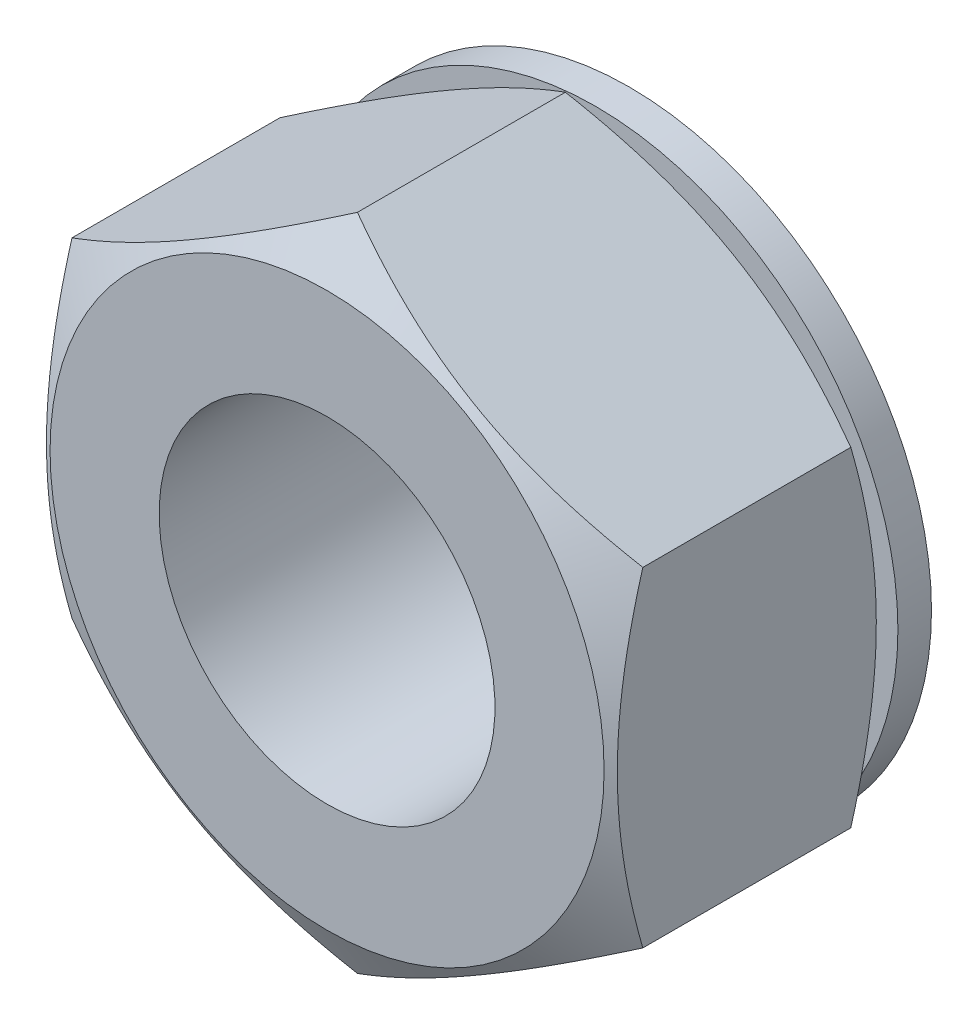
ISO-10303-21;
HEADER;
FILE_DESCRIPTION(('STEP AP214'),'2;1');
FILE_NAME('part.step','',(''),(''),'','','');
FILE_SCHEMA(('AUTOMOTIVE_DESIGN { 1 0 10303 214 1 1 1 1 }'));
ENDSEC;
DATA;
#1=APPLICATION_CONTEXT('core data for automotive mechanical design processes');
#2=APPLICATION_PROTOCOL_DEFINITION('international standard','automotive_design',2000,#1);
#3=PRODUCT_CONTEXT('',#1,'mechanical');
#4=PRODUCT('Part','Part','',(#3));
#5=PRODUCT_RELATED_PRODUCT_CATEGORY('part','',(#4));
#6=PRODUCT_DEFINITION_FORMATION('','',#4);
#7=PRODUCT_DEFINITION_CONTEXT('part definition',#1,'design');
#8=PRODUCT_DEFINITION('design','',#6,#7);
#9=PRODUCT_DEFINITION_SHAPE('','',#8);
#10=(LENGTH_UNIT() NAMED_UNIT(*) SI_UNIT(.MILLI.,.METRE.));
#11=(NAMED_UNIT(*) PLANE_ANGLE_UNIT() SI_UNIT($,.RADIAN.));
#12=(NAMED_UNIT(*) SI_UNIT($,.STERADIAN.) SOLID_ANGLE_UNIT());
#13=UNCERTAINTY_MEASURE_WITH_UNIT(LENGTH_MEASURE(1.E-05),#10,'distance_accuracy_value','');
#14=(GEOMETRIC_REPRESENTATION_CONTEXT(3) GLOBAL_UNCERTAINTY_ASSIGNED_CONTEXT((#13)) GLOBAL_UNIT_ASSIGNED_CONTEXT((#10,
#11,#12)) REPRESENTATION_CONTEXT('',''));
#15=CARTESIAN_POINT('',(0.,0.,0.));
#16=DIRECTION('',(0.,0.,1.));
#17=DIRECTION('',(1.,0.,0.));
#18=AXIS2_PLACEMENT_3D('',#15,#16,#17);
#19=CARTESIAN_POINT('',(8.5,-4.90747728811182,1.));
#20=DIRECTION('',(1.,0.,0.));
#21=DIRECTION('',(0.,0.,-1.));
#22=AXIS2_PLACEMENT_3D('',#19,#20,#21);
#23=PLANE('',#22);
#24=DIRECTION('',(0.,0.,1.));
#25=VECTOR('',#24,1.);
#26=CARTESIAN_POINT('',(8.5,-4.90747728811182,1.));
#27=LINE('',#26,#25);
#28=CARTESIAN_POINT('',(8.5,-4.90747728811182,1.90352694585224));
#29=VERTEX_POINT('',#28);
#30=CARTESIAN_POINT('',(8.5,-4.90747728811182,8.09647305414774));
#31=VERTEX_POINT('',#30);
#32=EDGE_CURVE('E23',#29,#31,#27,.T.);
#33=ORIENTED_EDGE('',*,*,#32,.F.);
#34=CARTESIAN_POINT('',(8.5,-13.0915549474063,5.24868234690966));
#35=CARTESIAN_POINT('',(8.5,-12.7210522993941,5.06932129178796));
#36=CARTESIAN_POINT('',(8.5,-12.3496893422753,4.8917064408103));
#37=CARTESIAN_POINT('',(8.5,-11.6047849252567,4.54095312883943));
#38=CARTESIAN_POINT('',(8.5,-11.2312431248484,4.36781539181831));
#39=CARTESIAN_POINT('',(8.5,-10.4795547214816,4.02610976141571));
#40=CARTESIAN_POINT('',(8.5,-10.1013940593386,3.85757268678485));
#41=CARTESIAN_POINT('',(8.5,-9.34203313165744,3.52751781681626));
#42=CARTESIAN_POINT('',(8.5,-8.9608330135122,3.36599968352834));
#43=CARTESIAN_POINT('',(8.5,-8.18283943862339,3.0469393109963));
#44=CARTESIAN_POINT('',(8.5,-7.78593021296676,2.88967777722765));
#45=CARTESIAN_POINT('',(8.5,-6.98743583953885,2.58727756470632));
#46=CARTESIAN_POINT('',(8.5,-6.58585016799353,2.44214025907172));
#47=CARTESIAN_POINT('',(8.5,-5.77814054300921,2.16786564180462));
#48=CARTESIAN_POINT('',(8.5,-5.37202798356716,2.03869514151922));
#49=CARTESIAN_POINT('',(8.5,-4.55399343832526,1.80055665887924));
#50=CARTESIAN_POINT('',(8.5,-4.14207335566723,1.69158221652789));
#51=CARTESIAN_POINT('',(8.5,-3.31438796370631,1.49970658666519));
#52=CARTESIAN_POINT('',(8.5,-2.89865550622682,1.41666755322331));
#53=CARTESIAN_POINT('',(8.5,-2.27134456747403,1.31520073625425));
#54=CARTESIAN_POINT('',(8.5,-2.06160610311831,1.2852256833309));
#55=CARTESIAN_POINT('',(8.5,-1.64111774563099,1.23356271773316));
#56=CARTESIAN_POINT('',(8.5,-1.43036795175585,1.21187400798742));
#57=CARTESIAN_POINT('',(8.5,-1.01085234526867,1.17748318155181));
#58=CARTESIAN_POINT('',(8.5,-0.802095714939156,1.16466947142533));
#59=CARTESIAN_POINT('',(8.5,-0.384227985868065,1.14787493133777));
#60=CARTESIAN_POINT('',(8.5,-0.17511689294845,1.14389395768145));
#61=CARTESIAN_POINT('',(8.5,0.243087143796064,1.14485962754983));
#62=CARTESIAN_POINT('',(8.5,0.45218008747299,1.14980633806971));
#63=CARTESIAN_POINT('',(8.5,0.869974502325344,1.1685082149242));
#64=CARTESIAN_POINT('',(8.5,1.07867595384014,1.18226381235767));
#65=CARTESIAN_POINT('',(8.5,1.5830262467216,1.22586154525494));
#66=CARTESIAN_POINT('',(8.5,1.87830686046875,1.26003717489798));
#67=CARTESIAN_POINT('',(8.5,2.46661820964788,1.34413868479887));
#68=CARTESIAN_POINT('',(8.5,2.75964862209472,1.39406678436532));
#69=CARTESIAN_POINT('',(8.5,3.34320037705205,1.50789692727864));
#70=CARTESIAN_POINT('',(8.5,3.63371951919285,1.57181014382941));
#71=CARTESIAN_POINT('',(8.5,4.21181524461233,1.7116655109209));
#72=CARTESIAN_POINT('',(8.5,4.49939187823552,1.78760745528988));
#73=CARTESIAN_POINT('',(8.5,5.07786906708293,1.95145666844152));
#74=CARTESIAN_POINT('',(8.5,5.36870556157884,2.0395885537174));
#75=CARTESIAN_POINT('',(8.5,5.94751266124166,2.22476097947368));
#76=CARTESIAN_POINT('',(8.5,6.23548324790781,2.3218015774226));
#77=CARTESIAN_POINT('',(8.5,6.80870426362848,2.52326797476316));
#78=CARTESIAN_POINT('',(8.5,7.09395560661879,2.62769118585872));
#79=CARTESIAN_POINT('',(8.5,7.66210792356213,2.84271370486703));
#80=CARTESIAN_POINT('',(8.5,7.94500892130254,2.9533129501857));
#81=CARTESIAN_POINT('',(8.5,8.59684880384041,3.2150416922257));
#82=CARTESIAN_POINT('',(8.5,8.9650387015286,3.36803342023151));
#83=CARTESIAN_POINT('',(8.5,9.69841979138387,3.68106229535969));
#84=CARTESIAN_POINT('',(8.5,10.0636108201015,3.84109982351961));
#85=CARTESIAN_POINT('',(8.5,10.7915324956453,4.16685178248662));
#86=CARTESIAN_POINT('',(8.5,11.1542626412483,4.33256733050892));
#87=CARTESIAN_POINT('',(8.5,11.8775879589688,4.66856623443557));
#88=CARTESIAN_POINT('',(8.5,12.2381831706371,4.83884950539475));
#89=CARTESIAN_POINT('',(8.5,12.9579418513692,5.18332507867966));
#90=CARTESIAN_POINT('',(8.5,13.317103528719,5.35752111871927));
#91=CARTESIAN_POINT('',(8.5,14.0339093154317,5.70901080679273));
#92=CARTESIAN_POINT('',(8.5,14.3915534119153,5.88630448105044));
#93=CARTESIAN_POINT('',(8.5,15.4624766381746,6.42198820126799));
#94=CARTESIAN_POINT('',(8.5,16.1738327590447,6.78422245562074));
#95=CARTESIAN_POINT('',(8.5,17.5359107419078,7.4866390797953));
#96=CARTESIAN_POINT('',(8.5,18.1869224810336,7.82626177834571));
#97=CARTESIAN_POINT('',(8.5,19.486513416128,8.51017567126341));
#98=CARTESIAN_POINT('',(8.5,20.1350925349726,8.85446701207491));
#99=CARTESIAN_POINT('',(8.5,21.4288467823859,9.54582326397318));
#100=CARTESIAN_POINT('',(8.5,22.0740263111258,9.89287995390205));
#101=CARTESIAN_POINT('',(8.5,23.3628204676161,10.5898096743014));
#102=CARTESIAN_POINT('',(8.5,24.0064351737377,10.9396825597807));
#103=CARTESIAN_POINT('',(8.5,24.6494692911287,11.2906121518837));
#104=B_SPLINE_CURVE_WITH_KNOTS('',3,(#34,#35,#36,#37,#38,#39,#40,#41,#42,#43,#44,#45,#46,#47,
#48,#49,#50,#51,#52,#53,#54,#55,#56,#57,#58,#59,#60,#61,#62,#63,#64,#65,#66,#67,#68,#69,#70,#71,
#72,#73,#74,#75,#76,#77,#78,#79,#80,#81,#82,#83,#84,#85,#86,#87,#88,#89,#90,#91,#92,#93,#94,#95,
#96,#97,#98,#99,#100,#101,#102,#103),.UNSPECIFIED.,.F.,.F.,(4,2,2,2,2,2,2,2,2,2,2,2,2,2,2,2,2,2,
2,2,2,2,2,2,2,2,2,2,2,2,2,2,2,2,4),(0.,1.23491770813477,2.47003387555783,3.71202833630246,
4.9539629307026,6.2345954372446,7.51537278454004,8.79344146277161,10.0711006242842,
11.3418487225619,11.9773195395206,12.6127292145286,13.2399967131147,13.867254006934,
14.4945160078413,15.121808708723,16.0130688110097,16.904454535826,17.7965550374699,
18.6886402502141,19.6001588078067,20.5116832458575,21.4228896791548,22.3340868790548,
23.5301212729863,24.7262204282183,25.9225562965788,27.1188699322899,28.3163795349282,
29.5138992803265,31.9086521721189,34.1114570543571,36.3143311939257,38.5121282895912,
40.7098129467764),.UNSPECIFIED.);
#105=CARTESIAN_POINT('',(8.5,4.90747728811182,1.90352694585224));
#106=VERTEX_POINT('',#105);
#107=EDGE_CURVE('E70',#29,#106,#104,.T.);
#108=ORIENTED_EDGE('',*,*,#107,.T.);
#109=DIRECTION('',(0.,0.,1.));
#110=VECTOR('',#109,1.);
#111=CARTESIAN_POINT('',(8.5,4.90747728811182,1.));
#112=LINE('',#111,#110);
#113=CARTESIAN_POINT('',(8.5,4.90747728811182,8.09647305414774));
#114=VERTEX_POINT('',#113);
#115=EDGE_CURVE('E38',#106,#114,#112,.T.);
#116=ORIENTED_EDGE('',*,*,#115,.T.);
#117=CARTESIAN_POINT('',(8.5,-13.217348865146,4.69031746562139));
#118=CARTESIAN_POINT('',(8.5,-12.8458016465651,4.8706926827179));
#119=CARTESIAN_POINT('',(8.5,-12.4734053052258,5.04934857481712));
#120=CARTESIAN_POINT('',(8.5,-11.7264629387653,5.40225544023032));
#121=CARTESIAN_POINT('',(8.5,-11.3519165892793,5.57650572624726));
#122=CARTESIAN_POINT('',(8.5,-10.598309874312,5.92050421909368));
#123=CARTESIAN_POINT('',(8.5,-10.2192360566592,6.09022305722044));
#124=CARTESIAN_POINT('',(8.5,-9.45808580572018,6.42276232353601));
#125=CARTESIAN_POINT('',(8.5,-9.07600951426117,6.58558307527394));
#126=CARTESIAN_POINT('',(8.5,-8.29577621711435,6.90765368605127));
#127=CARTESIAN_POINT('',(8.5,-7.89749985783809,7.06661599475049));
#128=CARTESIAN_POINT('',(8.5,-7.09630157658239,7.37259500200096));
#129=CARTESIAN_POINT('',(8.5,-6.69337914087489,7.51961036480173));
#130=CARTESIAN_POINT('',(8.5,-5.88298561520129,7.79786146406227));
#131=CARTESIAN_POINT('',(8.5,-5.47552550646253,7.92912884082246));
#132=CARTESIAN_POINT('',(8.5,-4.65477495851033,8.17169674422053));
#133=CARTESIAN_POINT('',(8.5,-4.24148638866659,8.28300352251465));
#134=CARTESIAN_POINT('',(8.5,-3.4110781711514,8.47973040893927));
#135=CARTESIAN_POINT('',(8.5,-2.99399303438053,8.56529227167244));
#136=CARTESIAN_POINT('',(8.5,-2.36453907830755,8.67064057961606));
#137=CARTESIAN_POINT('',(8.5,-2.15406819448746,8.70192568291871));
#138=CARTESIAN_POINT('',(8.5,-1.7320683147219,8.75621826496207));
#139=CARTESIAN_POINT('',(8.5,-1.52053942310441,8.77922654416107));
#140=CARTESIAN_POINT('',(8.5,-1.09948590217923,8.81621665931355));
#141=CARTESIAN_POINT('',(8.5,-0.889971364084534,8.83031290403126));
#142=CARTESIAN_POINT('',(8.5,-0.47053384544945,8.84963093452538));
#143=CARTESIAN_POINT('',(8.5,-0.26061087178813,8.85485286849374));
#144=CARTESIAN_POINT('',(8.5,0.159267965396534,8.85629759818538));
#145=CARTESIAN_POINT('',(8.5,0.369223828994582,8.8525203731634));
#146=CARTESIAN_POINT('',(8.5,0.788788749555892,8.83605958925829));
#147=CARTESIAN_POINT('',(8.5,0.998397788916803,8.82337559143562));
#148=CARTESIAN_POINT('',(8.5,1.50108256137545,8.78254579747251));
#149=CARTESIAN_POINT('',(8.5,1.793827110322,8.75023345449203));
#150=CARTESIAN_POINT('',(8.5,2.37715285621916,8.66999047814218));
#151=CARTESIAN_POINT('',(8.5,2.66773375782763,8.62205775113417));
#152=CARTESIAN_POINT('',(8.5,3.53589346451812,8.45736980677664));
#153=CARTESIAN_POINT('',(8.5,4.10956801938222,8.31975438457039));
#154=CARTESIAN_POINT('',(8.5,4.96741250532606,8.08098980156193));
#155=CARTESIAN_POINT('',(8.5,5.25602859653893,7.99489512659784));
#156=CARTESIAN_POINT('',(8.5,5.83045786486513,7.81373122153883));
#157=CARTESIAN_POINT('',(8.5,6.11627102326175,7.71866193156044));
#158=CARTESIAN_POINT('',(8.5,6.68518369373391,7.52107686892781));
#159=CARTESIAN_POINT('',(8.5,6.96828405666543,7.41856352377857));
#160=CARTESIAN_POINT('',(8.5,7.53213698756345,7.20729976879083));
#161=CARTESIAN_POINT('',(8.5,7.81288958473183,7.09854943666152));
#162=CARTESIAN_POINT('',(8.5,8.48212780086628,6.83212781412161));
#163=CARTESIAN_POINT('',(8.5,8.86963833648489,6.67201149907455));
#164=CARTESIAN_POINT('',(8.5,9.64130597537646,6.34386869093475));
#165=CARTESIAN_POINT('',(8.5,10.0254628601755,6.17584168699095));
#166=CARTESIAN_POINT('',(8.5,10.7910586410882,5.83348393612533));
#167=CARTESIAN_POINT('',(8.5,11.172496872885,5.65915170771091));
#168=CARTESIAN_POINT('',(8.5,11.9330253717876,5.30547364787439));
#169=CARTESIAN_POINT('',(8.5,12.3121156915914,5.12612792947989));
#170=CARTESIAN_POINT('',(8.5,13.0687747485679,4.76316764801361));
#171=CARTESIAN_POINT('',(8.5,13.4463412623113,4.57954845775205));
#172=CARTESIAN_POINT('',(8.5,14.1998317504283,4.2089715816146));
#173=CARTESIAN_POINT('',(8.5,14.5757557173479,4.0220138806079));
#174=CARTESIAN_POINT('',(8.5,15.7013597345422,3.45708243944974));
#175=CARTESIAN_POINT('',(8.5,16.448977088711,3.07499947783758));
#176=CARTESIAN_POINT('',(8.5,17.8763952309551,2.3362001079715));
#177=CARTESIAN_POINT('',(8.5,18.5565227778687,1.98011216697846));
#178=CARTESIAN_POINT('',(8.5,19.9142584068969,1.26310730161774));
#179=CARTESIAN_POINT('',(8.5,20.5918663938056,0.902190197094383));
#180=CARTESIAN_POINT('',(8.5,21.9433746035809,0.17762302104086));
#181=CARTESIAN_POINT('',(8.5,22.6172798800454,-0.186017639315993));
#182=CARTESIAN_POINT('',(8.5,23.963483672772,-0.91617087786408));
#183=CARTESIAN_POINT('',(8.5,24.6357822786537,-1.28268329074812));
#184=CARTESIAN_POINT('',(8.5,25.3074917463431,-1.65026503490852));
#185=B_SPLINE_CURVE_WITH_KNOTS('',3,(#117,#118,#119,#120,#121,#122,#123,#124,#125,#126,#127,
#128,#129,#130,#131,#132,#133,#134,#135,#136,#137,#138,#139,#140,#141,#142,#143,#144,#145,#146,
#147,#148,#149,#150,#151,#152,#153,#154,#155,#156,#157,#158,#159,#160,#161,#162,#163,#164,#165,
#166,#167,#168,#169,#170,#171,#172,#173,#174,#175,#176,#177,#178,#179,#180,#181,#182,#183,#184),
.UNSPECIFIED.,.F.,.F.,(4,2,2,2,2,2,2,2,2,2,2,2,2,2,2,2,2,2,2,2,2,2,2,2,2,2,2,2,2,2,2,2,2,4),(0.,
1.23906418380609,2.47832048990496,3.7242641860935,4.97014937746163,6.25648329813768,
7.54296084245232,8.82680874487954,10.1102538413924,11.3864970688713,12.0247099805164,
12.6628611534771,13.2926441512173,13.9224166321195,14.5521905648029,15.1819955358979,
16.0650645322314,16.9482519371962,18.7155902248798,19.6190649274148,20.5225456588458,
21.4257330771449,22.3289092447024,23.5866510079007,24.8444741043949,26.1025946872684,
27.3606869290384,28.6202113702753,29.8797415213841,32.3984513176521,34.7015479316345,
37.0047307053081,39.3019924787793,41.599122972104),.UNSPECIFIED.);
#186=EDGE_CURVE('E90',#31,#114,#185,.T.);
#187=ORIENTED_EDGE('',*,*,#186,.F.);
#188=EDGE_LOOP('',(#33,#108,#116,#187));
#189=FACE_BOUND('',#188,.T.);
#190=ADVANCED_FACE('F14',(#189),#23,.T.);
#191=CARTESIAN_POINT('',(8.5,-4.90747728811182,1.));
#192=DIRECTION('',(-0.5,0.866025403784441,0.));
#193=DIRECTION('',(0.866025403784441,0.5,0.));
#194=AXIS2_PLACEMENT_3D('',#191,#192,#193);
#195=PLANE('',#194);
#196=CARTESIAN_POINT('',(8.5002,-4.90736181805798,1.90359361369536));
#197=CARTESIAN_POINT('',(8.31336077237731,-5.01523349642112,1.84132370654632));
#198=CARTESIAN_POINT('',(8.1258249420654,-5.1235073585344,1.78187986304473));
#199=CARTESIAN_POINT('',(7.74923024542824,-5.34093440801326,1.66942267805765));
#200=CARTESIAN_POINT('',(7.56017075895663,-5.45008795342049,1.61641211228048));
#201=CARTESIAN_POINT('',(6.9899652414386,-5.77929626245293,1.46807095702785));
#202=CARTESIAN_POINT('',(6.60656835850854,-6.00065055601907,1.38369649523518));
#203=CARTESIAN_POINT('',(6.03282233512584,-6.33190297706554,1.28475758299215));
#204=CARTESIAN_POINT('',(5.84418723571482,-6.44081150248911,1.2565727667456));
#205=CARTESIAN_POINT('',(5.46606397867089,-6.65912106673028,1.2093116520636));
#206=CARTESIAN_POINT('',(5.27657589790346,-6.76852206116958,1.19023454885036));
#207=CARTESIAN_POINT('',(4.8972734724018,-6.98751241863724,1.1616723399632));
#208=CARTESIAN_POINT('',(4.70745974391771,-7.09710142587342,1.15217634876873));
#209=CARTESIAN_POINT('',(4.32765694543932,-7.31638067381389,1.14297994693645));
#210=CARTESIAN_POINT('',(4.13766788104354,-7.42607091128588,1.14327923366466));
#211=CARTESIAN_POINT('',(3.78247698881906,-7.63114046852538,1.1529920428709));
#212=CARTESIAN_POINT('',(3.6172500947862,-7.72653426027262,1.16122073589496));
#213=CARTESIAN_POINT('',(3.28718328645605,-7.91709842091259,1.18492680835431));
#214=CARTESIAN_POINT('',(3.12234339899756,-8.01226877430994,1.2004046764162));
#215=CARTESIAN_POINT('',(2.62846189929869,-8.29741139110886,1.25734618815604));
#216=CARTESIAN_POINT('',(2.30029449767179,-8.48687892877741,1.30931062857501));
#217=CARTESIAN_POINT('',(1.64047857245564,-8.86782383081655,1.43922250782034));
#218=CARTESIAN_POINT('',(1.30891425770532,-9.05925257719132,1.51772063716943));
#219=CARTESIAN_POINT('',(0.65073010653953,-9.43925537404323,1.69587890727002));
#220=CARTESIAN_POINT('',(0.324101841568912,-9.62783429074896,1.79549720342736));
#221=CARTESIAN_POINT('',(-0.000200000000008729,-9.81507004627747,1.90359361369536));
#222=B_SPLINE_CURVE_WITH_KNOTS('',3,(#196,#197,#198,#199,#200,#201,#202,#203,#204,#205,#206,
#207,#208,#209,#210,#211,#212,#213,#214,#215,#216,#217,#218,#219,#220,#221),.UNSPECIFIED.,.F.,
.F.,(4,2,2,2,2,2,2,2,2,2,2,2,4),(0.,0.673596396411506,1.34748239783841,2.69805431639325,
3.35679995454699,4.01548737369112,4.67342558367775,5.33134346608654,5.90409556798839,
6.47688628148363,7.62328361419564,8.79510569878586,9.9646274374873),.UNSPECIFIED.);
#223=CARTESIAN_POINT('',(0.,-9.81495457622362,1.90352694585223));
#224=VERTEX_POINT('',#223);
#225=EDGE_CURVE('E78',#29,#224,#222,.T.);
#226=ORIENTED_EDGE('',*,*,#225,.F.);
#227=ORIENTED_EDGE('',*,*,#32,.T.);
#228=CARTESIAN_POINT('',(8.5002,-4.90736181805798,8.09640638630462));
#229=CARTESIAN_POINT('',(8.31336077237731,-5.01523349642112,8.15867629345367));
#230=CARTESIAN_POINT('',(8.1258249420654,-5.1235073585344,8.21812013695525));
#231=CARTESIAN_POINT('',(7.74923024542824,-5.34093440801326,8.33057732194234));
#232=CARTESIAN_POINT('',(7.56017075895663,-5.45008795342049,8.38358788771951));
#233=CARTESIAN_POINT('',(6.9899652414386,-5.77929626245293,8.53192904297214));
#234=CARTESIAN_POINT('',(6.60656835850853,-6.00065055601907,8.61630350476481));
#235=CARTESIAN_POINT('',(6.03282233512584,-6.33190297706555,8.71524241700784));
#236=CARTESIAN_POINT('',(5.84418723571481,-6.44081150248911,8.7434272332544));
#237=CARTESIAN_POINT('',(5.46606397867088,-6.65912106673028,8.79068834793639));
#238=CARTESIAN_POINT('',(5.27657589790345,-6.76852206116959,8.80976545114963));
#239=CARTESIAN_POINT('',(4.89727347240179,-6.98751241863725,8.83832766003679));
#240=CARTESIAN_POINT('',(4.7074597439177,-7.09710142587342,8.84782365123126));
#241=CARTESIAN_POINT('',(4.32765694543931,-7.3163806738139,8.85702005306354));
#242=CARTESIAN_POINT('',(4.13766788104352,-7.42607091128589,8.85672076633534));
#243=CARTESIAN_POINT('',(3.78247698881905,-7.63114046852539,8.8470079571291));
#244=CARTESIAN_POINT('',(3.6172500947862,-7.72653426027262,8.83877926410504));
#245=CARTESIAN_POINT('',(3.28718328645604,-7.9170984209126,8.81507319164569));
#246=CARTESIAN_POINT('',(3.12234339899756,-8.01226877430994,8.79959532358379));
#247=CARTESIAN_POINT('',(2.62846189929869,-8.29741139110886,8.74265381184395));
#248=CARTESIAN_POINT('',(2.30029449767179,-8.48687892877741,8.69068937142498));
#249=CARTESIAN_POINT('',(1.64047857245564,-8.86782383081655,8.56077749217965));
#250=CARTESIAN_POINT('',(1.30891425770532,-9.05925257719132,8.48227936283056));
#251=CARTESIAN_POINT('',(0.650730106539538,-9.43925537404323,8.30412109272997));
#252=CARTESIAN_POINT('',(0.324101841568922,-9.62783429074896,8.20450279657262));
#253=CARTESIAN_POINT('',(-0.000199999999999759,-9.81507004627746,8.09640638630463));
#254=B_SPLINE_CURVE_WITH_KNOTS('',3,(#228,#229,#230,#231,#232,#233,#234,#235,#236,#237,#238,
#239,#240,#241,#242,#243,#244,#245,#246,#247,#248,#249,#250,#251,#252,#253),.UNSPECIFIED.,.F.,
.F.,(4,2,2,2,2,2,2,2,2,2,2,2,4),(0.,0.673596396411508,1.34748239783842,2.69805431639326,
3.356799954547,4.01548737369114,4.67342558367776,5.33134346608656,5.9040955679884,
6.47688628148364,7.62328361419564,8.79510569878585,9.96462743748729),.UNSPECIFIED.);
#255=CARTESIAN_POINT('',(0.,-9.81495457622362,8.09647305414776));
#256=VERTEX_POINT('',#255);
#257=EDGE_CURVE('E102',#31,#256,#254,.T.);
#258=ORIENTED_EDGE('',*,*,#257,.T.);
#259=DIRECTION('',(0.,0.,1.));
#260=VECTOR('',#259,1.);
#261=CARTESIAN_POINT('',(0.,-9.81495457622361,1.));
#262=LINE('',#261,#260);
#263=EDGE_CURVE('E97',#224,#256,#262,.T.);
#264=ORIENTED_EDGE('',*,*,#263,.F.);
#265=EDGE_LOOP('',(#226,#227,#258,#264));
#266=FACE_BOUND('',#265,.T.);
#267=ADVANCED_FACE('F16',(#266),#195,.F.);
#268=CARTESIAN_POINT('',(-8.5,-4.90747728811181,1.));
#269=DIRECTION('',(-0.5,-0.86602540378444,0.));
#270=DIRECTION('',(-0.86602540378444,0.5,0.));
#271=AXIS2_PLACEMENT_3D('',#268,#269,#270);
#272=PLANE('',#271);
#273=DIRECTION('',(0.,0.,1.));
#274=VECTOR('',#273,1.);
#275=CARTESIAN_POINT('',(-8.5,-4.90747728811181,1.));
#276=LINE('',#275,#274);
#277=CARTESIAN_POINT('',(-8.5,-4.90747728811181,1.90352694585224));
#278=VERTEX_POINT('',#277);
#279=CARTESIAN_POINT('',(-8.5,-4.90747728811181,8.09647305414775));
#280=VERTEX_POINT('',#279);
#281=EDGE_CURVE('E95',#278,#280,#276,.T.);
#282=ORIENTED_EDGE('',*,*,#281,.F.);
#283=CARTESIAN_POINT('',(-8.5002,-4.90736181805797,1.90359361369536));
#284=CARTESIAN_POINT('',(-8.31336077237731,-5.01523349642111,1.84132370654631));
#285=CARTESIAN_POINT('',(-8.1258249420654,-5.12350735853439,1.78187986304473));
#286=CARTESIAN_POINT('',(-7.74923024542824,-5.34093440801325,1.66942267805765));
#287=CARTESIAN_POINT('',(-7.56017075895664,-5.45008795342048,1.61641211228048));
#288=CARTESIAN_POINT('',(-6.98996524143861,-5.77929626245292,1.46807095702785));
#289=CARTESIAN_POINT('',(-6.60656835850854,-6.00065055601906,1.38369649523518));
#290=CARTESIAN_POINT('',(-6.03282233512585,-6.33190297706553,1.28475758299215));
#291=CARTESIAN_POINT('',(-5.84418723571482,-6.4408115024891,1.25657276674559));
#292=CARTESIAN_POINT('',(-5.4660639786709,-6.65912106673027,1.2093116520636));
#293=CARTESIAN_POINT('',(-5.27657589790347,-6.76852206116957,1.19023454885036));
#294=CARTESIAN_POINT('',(-4.89727347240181,-6.98751241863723,1.1616723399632));
#295=CARTESIAN_POINT('',(-4.70745974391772,-7.09710142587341,1.15217634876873));
#296=CARTESIAN_POINT('',(-4.32765694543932,-7.31638067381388,1.14297994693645));
#297=CARTESIAN_POINT('',(-4.13766788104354,-7.42607091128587,1.14327923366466));
#298=CARTESIAN_POINT('',(-3.78247698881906,-7.63114046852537,1.1529920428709));
#299=CARTESIAN_POINT('',(-3.61725009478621,-7.72653426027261,1.16122073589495));
#300=CARTESIAN_POINT('',(-3.28718328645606,-7.91709842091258,1.1849268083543));
#301=CARTESIAN_POINT('',(-3.12234339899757,-8.01226877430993,1.2004046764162));
#302=CARTESIAN_POINT('',(-2.6284618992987,-8.29741139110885,1.25734618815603));
#303=CARTESIAN_POINT('',(-2.3002944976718,-8.4868789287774,1.309310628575));
#304=CARTESIAN_POINT('',(-1.64047857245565,-8.86782383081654,1.43922250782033));
#305=CARTESIAN_POINT('',(-1.30891425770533,-9.05925257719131,1.51772063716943));
#306=CARTESIAN_POINT('',(-0.650730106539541,-9.43925537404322,1.69587890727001));
#307=CARTESIAN_POINT('',(-0.324101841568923,-9.62783429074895,1.79549720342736));
#308=CARTESIAN_POINT('',(0.000199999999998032,-9.81507004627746,1.90359361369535));
#309=B_SPLINE_CURVE_WITH_KNOTS('',3,(#283,#284,#285,#286,#287,#288,#289,#290,#291,#292,#293,
#294,#295,#296,#297,#298,#299,#300,#301,#302,#303,#304,#305,#306,#307,#308),.UNSPECIFIED.,.F.,
.F.,(4,2,2,2,2,2,2,2,2,2,2,2,4),(0.,0.673596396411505,1.34748239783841,2.69805431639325,
3.35679995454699,4.01548737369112,4.67342558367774,5.33134346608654,5.90409556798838,
6.47688628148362,7.62328361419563,8.79510569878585,9.96462743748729),.UNSPECIFIED.);
#310=EDGE_CURVE('E169',#278,#224,#309,.T.);
#311=ORIENTED_EDGE('',*,*,#310,.T.);
#312=ORIENTED_EDGE('',*,*,#263,.T.);
#313=CARTESIAN_POINT('',(-8.5002,-4.90736181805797,8.09640638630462));
#314=CARTESIAN_POINT('',(-8.31336077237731,-5.01523349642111,8.15867629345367));
#315=CARTESIAN_POINT('',(-8.1258249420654,-5.12350735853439,8.21812013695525));
#316=CARTESIAN_POINT('',(-7.74923024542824,-5.34093440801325,8.33057732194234));
#317=CARTESIAN_POINT('',(-7.56017075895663,-5.45008795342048,8.38358788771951));
#318=CARTESIAN_POINT('',(-6.9899652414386,-5.77929626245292,8.53192904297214));
#319=CARTESIAN_POINT('',(-6.60656835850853,-6.00065055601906,8.61630350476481));
#320=CARTESIAN_POINT('',(-6.03282233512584,-6.33190297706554,8.71524241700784));
#321=CARTESIAN_POINT('',(-5.84418723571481,-6.4408115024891,8.7434272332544));
#322=CARTESIAN_POINT('',(-5.46606397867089,-6.65912106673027,8.7906883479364));
#323=CARTESIAN_POINT('',(-5.27657589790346,-6.76852206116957,8.80976545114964));
#324=CARTESIAN_POINT('',(-4.8972734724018,-6.98751241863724,8.83832766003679));
#325=CARTESIAN_POINT('',(-4.7074597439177,-7.09710142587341,8.84782365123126));
#326=CARTESIAN_POINT('',(-4.32765694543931,-7.31638067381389,8.85702005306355));
#327=CARTESIAN_POINT('',(-4.13766788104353,-7.42607091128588,8.85672076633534));
#328=CARTESIAN_POINT('',(-3.78247698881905,-7.63114046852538,8.8470079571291));
#329=CARTESIAN_POINT('',(-3.6172500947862,-7.72653426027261,8.83877926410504));
#330=CARTESIAN_POINT('',(-3.28718328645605,-7.91709842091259,8.81507319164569));
#331=CARTESIAN_POINT('',(-3.12234339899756,-8.01226877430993,8.79959532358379));
#332=CARTESIAN_POINT('',(-2.62846189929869,-8.29741139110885,8.74265381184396));
#333=CARTESIAN_POINT('',(-2.30029449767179,-8.4868789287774,8.69068937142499));
#334=CARTESIAN_POINT('',(-1.64047857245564,-8.86782383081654,8.56077749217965));
#335=CARTESIAN_POINT('',(-1.30891425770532,-9.05925257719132,8.48227936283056));
#336=CARTESIAN_POINT('',(-0.650730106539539,-9.43925537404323,8.30412109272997));
#337=CARTESIAN_POINT('',(-0.324101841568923,-9.62783429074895,8.20450279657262));
#338=CARTESIAN_POINT('',(0.000199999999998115,-9.81507004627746,8.09640638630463));
#339=B_SPLINE_CURVE_WITH_KNOTS('',3,(#313,#314,#315,#316,#317,#318,#319,#320,#321,#322,#323,
#324,#325,#326,#327,#328,#329,#330,#331,#332,#333,#334,#335,#336,#337,#338),.UNSPECIFIED.,.F.,
.F.,(4,2,2,2,2,2,2,2,2,2,2,2,4),(0.,0.673596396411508,1.34748239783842,2.69805431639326,
3.356799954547,4.01548737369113,4.67342558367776,5.33134346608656,5.9040955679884,
6.47688628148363,7.62328361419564,8.79510569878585,9.96462743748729),.UNSPECIFIED.);
#340=EDGE_CURVE('E109',#280,#256,#339,.T.);
#341=ORIENTED_EDGE('',*,*,#340,.F.);
#342=EDGE_LOOP('',(#282,#311,#312,#341));
#343=FACE_BOUND('',#342,.T.);
#344=ADVANCED_FACE('F161',(#343),#272,.T.);
#345=CARTESIAN_POINT('',(-8.5,-4.90747728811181,1.));
#346=DIRECTION('',(1.,0.,0.));
#347=DIRECTION('',(0.,0.,-1.));
#348=AXIS2_PLACEMENT_3D('',#345,#346,#347);
#349=PLANE('',#348);
#350=CARTESIAN_POINT('',(-8.5,-13.0915549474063,5.24868234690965));
#351=CARTESIAN_POINT('',(-8.5,-12.7210522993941,5.06932129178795));
#352=CARTESIAN_POINT('',(-8.5,-12.3496893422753,4.89170644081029));
#353=CARTESIAN_POINT('',(-8.5,-11.6047849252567,4.54095312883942));
#354=CARTESIAN_POINT('',(-8.5,-11.2312431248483,4.36781539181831));
#355=CARTESIAN_POINT('',(-8.5,-10.4795547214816,4.0261097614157));
#356=CARTESIAN_POINT('',(-8.5,-10.1013940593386,3.85757268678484));
#357=CARTESIAN_POINT('',(-8.5,-9.34203313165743,3.52751781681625));
#358=CARTESIAN_POINT('',(-8.5,-8.96083301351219,3.36599968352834));
#359=CARTESIAN_POINT('',(-8.5,-8.18283943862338,3.0469393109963));
#360=CARTESIAN_POINT('',(-8.5,-7.78593021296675,2.88967777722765));
#361=CARTESIAN_POINT('',(-8.5,-6.98743583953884,2.58727756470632));
#362=CARTESIAN_POINT('',(-8.5,-6.58585016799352,2.44214025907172));
#363=CARTESIAN_POINT('',(-8.5,-5.7781405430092,2.16786564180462));
#364=CARTESIAN_POINT('',(-8.5,-5.37202798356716,2.03869514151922));
#365=CARTESIAN_POINT('',(-8.5,-4.55399343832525,1.80055665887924));
#366=CARTESIAN_POINT('',(-8.5,-4.14207335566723,1.69158221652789));
#367=CARTESIAN_POINT('',(-8.5,-3.31438796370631,1.49970658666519));
#368=CARTESIAN_POINT('',(-8.5,-2.89865550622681,1.41666755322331));
#369=CARTESIAN_POINT('',(-8.5,-2.27134456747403,1.31520073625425));
#370=CARTESIAN_POINT('',(-8.5,-2.0616061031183,1.2852256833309));
#371=CARTESIAN_POINT('',(-8.5,-1.64111774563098,1.23356271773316));
#372=CARTESIAN_POINT('',(-8.5,-1.43036795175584,1.21187400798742));
#373=CARTESIAN_POINT('',(-8.5,-1.01085234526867,1.17748318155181));
#374=CARTESIAN_POINT('',(-8.5,-0.80209571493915,1.16466947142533));
#375=CARTESIAN_POINT('',(-8.5,-0.384227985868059,1.14787493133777));
#376=CARTESIAN_POINT('',(-8.5,-0.175116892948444,1.14389395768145));
#377=CARTESIAN_POINT('',(-8.5,0.243087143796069,1.14485962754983));
#378=CARTESIAN_POINT('',(-8.5,0.452180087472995,1.14980633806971));
#379=CARTESIAN_POINT('',(-8.5,0.869974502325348,1.1685082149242));
#380=CARTESIAN_POINT('',(-8.5,1.07867595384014,1.18226381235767));
#381=CARTESIAN_POINT('',(-8.5,1.58302624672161,1.22586154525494));
#382=CARTESIAN_POINT('',(-8.5,1.87830686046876,1.26003717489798));
#383=CARTESIAN_POINT('',(-8.5,2.46661820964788,1.34413868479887));
#384=CARTESIAN_POINT('',(-8.5,2.75964862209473,1.39406678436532));
#385=CARTESIAN_POINT('',(-8.5,3.34320037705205,1.50789692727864));
#386=CARTESIAN_POINT('',(-8.5,3.63371951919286,1.57181014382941));
#387=CARTESIAN_POINT('',(-8.5,4.21181524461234,1.7116655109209));
#388=CARTESIAN_POINT('',(-8.5,4.49939187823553,1.78760745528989));
#389=CARTESIAN_POINT('',(-8.5,5.07786906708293,1.95145666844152));
#390=CARTESIAN_POINT('',(-8.5,5.36870556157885,2.0395885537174));
#391=CARTESIAN_POINT('',(-8.5,5.94751266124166,2.22476097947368));
#392=CARTESIAN_POINT('',(-8.5,6.23548324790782,2.32180157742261));
#393=CARTESIAN_POINT('',(-8.5,6.80870426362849,2.52326797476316));
#394=CARTESIAN_POINT('',(-8.5,7.0939556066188,2.62769118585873));
#395=CARTESIAN_POINT('',(-8.5,7.66210792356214,2.84271370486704));
#396=CARTESIAN_POINT('',(-8.5,7.94500892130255,2.95331295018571));
#397=CARTESIAN_POINT('',(-8.5,8.59684880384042,3.21504169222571));
#398=CARTESIAN_POINT('',(-8.5,8.96503870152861,3.36803342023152));
#399=CARTESIAN_POINT('',(-8.5,9.69841979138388,3.68106229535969));
#400=CARTESIAN_POINT('',(-8.5,10.0636108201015,3.84109982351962));
#401=CARTESIAN_POINT('',(-8.5,10.7915324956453,4.16685178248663));
#402=CARTESIAN_POINT('',(-8.5,11.1542626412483,4.33256733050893));
#403=CARTESIAN_POINT('',(-8.5,11.8775879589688,4.66856623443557));
#404=CARTESIAN_POINT('',(-8.5,12.2381831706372,4.83884950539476));
#405=CARTESIAN_POINT('',(-8.5,12.9579418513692,5.18332507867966));
#406=CARTESIAN_POINT('',(-8.5,13.317103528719,5.35752111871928));
#407=CARTESIAN_POINT('',(-8.5,14.0339093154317,5.70901080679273));
#408=CARTESIAN_POINT('',(-8.5,14.3915534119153,5.88630448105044));
#409=CARTESIAN_POINT('',(-8.5,15.4624766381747,6.421988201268));
#410=CARTESIAN_POINT('',(-8.5,16.1738327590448,6.78422245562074));
#411=CARTESIAN_POINT('',(-8.5,17.5359107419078,7.4866390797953));
#412=CARTESIAN_POINT('',(-8.5,18.1869224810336,7.82626177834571));
#413=CARTESIAN_POINT('',(-8.5,19.486513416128,8.51017567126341));
#414=CARTESIAN_POINT('',(-8.5,20.1350925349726,8.85446701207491));
#415=CARTESIAN_POINT('',(-8.5,21.4288467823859,9.54582326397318));
#416=CARTESIAN_POINT('',(-8.5,22.0740263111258,9.89287995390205));
#417=CARTESIAN_POINT('',(-8.5,23.3628204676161,10.5898096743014));
#418=CARTESIAN_POINT('',(-8.5,24.0064351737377,10.9396825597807));
#419=CARTESIAN_POINT('',(-8.5,24.6494692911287,11.2906121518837));
#420=B_SPLINE_CURVE_WITH_KNOTS('',3,(#350,#351,#352,#353,#354,#355,#356,#357,#358,#359,#360,
#361,#362,#363,#364,#365,#366,#367,#368,#369,#370,#371,#372,#373,#374,#375,#376,#377,#378,#379,
#380,#381,#382,#383,#384,#385,#386,#387,#388,#389,#390,#391,#392,#393,#394,#395,#396,#397,#398,
#399,#400,#401,#402,#403,#404,#405,#406,#407,#408,#409,#410,#411,#412,#413,#414,#415,#416,#417,
#418,#419),.UNSPECIFIED.,.F.,.F.,(4,2,2,2,2,2,2,2,2,2,2,2,2,2,2,2,2,2,2,2,2,2,2,2,2,2,2,2,2,2,2,
2,2,2,4),(0.,1.23491770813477,2.47003387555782,3.71202833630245,4.95396293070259,
6.23459543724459,7.51537278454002,8.79344146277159,10.0711006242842,11.3418487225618,
11.9773195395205,12.6127292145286,13.2399967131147,13.867254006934,14.4945160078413,
15.121808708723,16.0130688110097,16.904454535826,17.7965550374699,18.6886402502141,
19.6001588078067,20.5116832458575,21.4228896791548,22.3340868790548,23.5301212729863,
24.7262204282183,25.9225562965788,27.1188699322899,28.3163795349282,29.5138992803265,
31.9086521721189,34.1114570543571,36.3143311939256,38.5121282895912,40.7098129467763),.UNSPECIFIED.);
#421=CARTESIAN_POINT('',(-8.5,4.90747728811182,1.90352694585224));
#422=VERTEX_POINT('',#421);
#423=EDGE_CURVE('E177',#278,#422,#420,.T.);
#424=ORIENTED_EDGE('',*,*,#423,.F.);
#425=ORIENTED_EDGE('',*,*,#281,.T.);
#426=CARTESIAN_POINT('',(-8.5,-13.217348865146,4.6903174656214));
#427=CARTESIAN_POINT('',(-8.5,-12.8458016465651,4.87069268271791));
#428=CARTESIAN_POINT('',(-8.5,-12.4734053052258,5.04934857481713));
#429=CARTESIAN_POINT('',(-8.5,-11.7264629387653,5.40225544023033));
#430=CARTESIAN_POINT('',(-8.5,-11.3519165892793,5.57650572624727));
#431=CARTESIAN_POINT('',(-8.5,-10.5983098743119,5.92050421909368));
#432=CARTESIAN_POINT('',(-8.5,-10.2192360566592,6.09022305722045));
#433=CARTESIAN_POINT('',(-8.5,-9.45808580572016,6.42276232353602));
#434=CARTESIAN_POINT('',(-8.5,-9.07600951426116,6.58558307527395));
#435=CARTESIAN_POINT('',(-8.5,-8.29577621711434,6.90765368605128));
#436=CARTESIAN_POINT('',(-8.5,-7.89749985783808,7.0666159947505));
#437=CARTESIAN_POINT('',(-8.5,-7.09630157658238,7.37259500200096));
#438=CARTESIAN_POINT('',(-8.5,-6.69337914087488,7.51961036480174));
#439=CARTESIAN_POINT('',(-8.5,-5.88298561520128,7.79786146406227));
#440=CARTESIAN_POINT('',(-8.5,-5.47552550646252,7.92912884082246));
#441=CARTESIAN_POINT('',(-8.5,-4.65477495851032,8.17169674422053));
#442=CARTESIAN_POINT('',(-8.5,-4.24148638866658,8.28300352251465));
#443=CARTESIAN_POINT('',(-8.5,-3.41107817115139,8.47973040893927));
#444=CARTESIAN_POINT('',(-8.5,-2.99399303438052,8.56529227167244));
#445=CARTESIAN_POINT('',(-8.5,-2.36453907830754,8.67064057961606));
#446=CARTESIAN_POINT('',(-8.5,-2.15406819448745,8.70192568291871));
#447=CARTESIAN_POINT('',(-8.5,-1.73206831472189,8.75621826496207));
#448=CARTESIAN_POINT('',(-8.5,-1.5205394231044,8.77922654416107));
#449=CARTESIAN_POINT('',(-8.5,-1.09948590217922,8.81621665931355));
#450=CARTESIAN_POINT('',(-8.5,-0.889971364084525,8.83031290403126));
#451=CARTESIAN_POINT('',(-8.5,-0.470533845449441,8.84963093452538));
#452=CARTESIAN_POINT('',(-8.5,-0.26061087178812,8.85485286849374));
#453=CARTESIAN_POINT('',(-8.5,0.159267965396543,8.85629759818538));
#454=CARTESIAN_POINT('',(-8.5,0.36922382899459,8.8525203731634));
#455=CARTESIAN_POINT('',(-8.5,0.7887887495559,8.83605958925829));
#456=CARTESIAN_POINT('',(-8.5,0.998397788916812,8.82337559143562));
#457=CARTESIAN_POINT('',(-8.5,1.50108256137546,8.78254579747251));
#458=CARTESIAN_POINT('',(-8.5,1.79382711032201,8.75023345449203));
#459=CARTESIAN_POINT('',(-8.5,2.37715285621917,8.66999047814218));
#460=CARTESIAN_POINT('',(-8.5,2.66773375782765,8.62205775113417));
#461=CARTESIAN_POINT('',(-8.5,3.53589346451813,8.45736980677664));
#462=CARTESIAN_POINT('',(-8.5,4.10956801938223,8.31975438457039));
#463=CARTESIAN_POINT('',(-8.5,4.96741250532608,8.08098980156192));
#464=CARTESIAN_POINT('',(-8.5,5.25602859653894,7.99489512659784));
#465=CARTESIAN_POINT('',(-8.5,5.83045786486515,7.81373122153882));
#466=CARTESIAN_POINT('',(-8.5,6.11627102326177,7.71866193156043));
#467=CARTESIAN_POINT('',(-8.5,6.68518369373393,7.5210768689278));
#468=CARTESIAN_POINT('',(-8.5,6.96828405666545,7.41856352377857));
#469=CARTESIAN_POINT('',(-8.5,7.53213698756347,7.20729976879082));
#470=CARTESIAN_POINT('',(-8.5,7.81288958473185,7.09854943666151));
#471=CARTESIAN_POINT('',(-8.5,8.4821278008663,6.8321278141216));
#472=CARTESIAN_POINT('',(-8.5,8.86963833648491,6.67201149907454));
#473=CARTESIAN_POINT('',(-8.5,9.64130597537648,6.34386869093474));
#474=CARTESIAN_POINT('',(-8.5,10.0254628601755,6.17584168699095));
#475=CARTESIAN_POINT('',(-8.5,10.7910586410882,5.83348393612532));
#476=CARTESIAN_POINT('',(-8.5,11.172496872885,5.6591517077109));
#477=CARTESIAN_POINT('',(-8.5,11.9330253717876,5.30547364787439));
#478=CARTESIAN_POINT('',(-8.5,12.3121156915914,5.12612792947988));
#479=CARTESIAN_POINT('',(-8.5,13.068774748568,4.7631676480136));
#480=CARTESIAN_POINT('',(-8.5,13.4463412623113,4.57954845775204));
#481=CARTESIAN_POINT('',(-8.5,14.1998317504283,4.20897158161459));
#482=CARTESIAN_POINT('',(-8.5,14.5757557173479,4.0220138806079));
#483=CARTESIAN_POINT('',(-8.5,15.7013597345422,3.45708243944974));
#484=CARTESIAN_POINT('',(-8.5,16.448977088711,3.07499947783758));
#485=CARTESIAN_POINT('',(-8.5,17.8763952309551,2.3362001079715));
#486=CARTESIAN_POINT('',(-8.5,18.5565227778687,1.98011216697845));
#487=CARTESIAN_POINT('',(-8.5,19.9142584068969,1.26310730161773));
#488=CARTESIAN_POINT('',(-8.5,20.5918663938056,0.902190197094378));
#489=CARTESIAN_POINT('',(-8.5,21.9433746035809,0.177623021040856));
#490=CARTESIAN_POINT('',(-8.5,22.6172798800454,-0.186017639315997));
#491=CARTESIAN_POINT('',(-8.5,23.963483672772,-0.916170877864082));
#492=CARTESIAN_POINT('',(-8.5,24.6357822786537,-1.28268329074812));
#493=CARTESIAN_POINT('',(-8.5,25.3074917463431,-1.65026503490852));
#494=B_SPLINE_CURVE_WITH_KNOTS('',3,(#426,#427,#428,#429,#430,#431,#432,#433,#434,#435,#436,
#437,#438,#439,#440,#441,#442,#443,#444,#445,#446,#447,#448,#449,#450,#451,#452,#453,#454,#455,
#456,#457,#458,#459,#460,#461,#462,#463,#464,#465,#466,#467,#468,#469,#470,#471,#472,#473,#474,
#475,#476,#477,#478,#479,#480,#481,#482,#483,#484,#485,#486,#487,#488,#489,#490,#491,#492,#493),
.UNSPECIFIED.,.F.,.F.,(4,2,2,2,2,2,2,2,2,2,2,2,2,2,2,2,2,2,2,2,2,2,2,2,2,2,2,2,2,2,2,2,2,4),(0.,
1.23906418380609,2.47832048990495,3.72426418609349,4.97014937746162,6.25648329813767,
7.54296084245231,8.82680874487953,10.1102538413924,11.3864970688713,12.0247099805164,
12.6628611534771,13.2926441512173,13.9224166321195,14.5521905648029,15.1819955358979,
16.0650645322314,16.9482519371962,18.7155902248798,19.6190649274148,20.5225456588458,
21.4257330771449,22.3289092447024,23.5866510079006,24.8444741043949,26.1025946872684,
27.3606869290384,28.6202113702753,29.8797415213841,32.3984513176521,34.7015479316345,
37.0047307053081,39.3019924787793,41.599122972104),.UNSPECIFIED.);
#495=CARTESIAN_POINT('',(-8.5,4.90747728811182,8.09647305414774));
#496=VERTEX_POINT('',#495);
#497=EDGE_CURVE('E151',#280,#496,#494,.T.);
#498=ORIENTED_EDGE('',*,*,#497,.T.);
#499=DIRECTION('',(0.,0.,1.));
#500=VECTOR('',#499,1.);
#501=CARTESIAN_POINT('',(-8.5,4.90747728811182,1.));
#502=LINE('',#501,#500);
#503=EDGE_CURVE('E87',#422,#496,#502,.T.);
#504=ORIENTED_EDGE('',*,*,#503,.F.);
#505=EDGE_LOOP('',(#424,#425,#498,#504));
#506=FACE_BOUND('',#505,.T.);
#507=ADVANCED_FACE('F164',(#506),#349,.F.);
#508=CARTESIAN_POINT('',(-8.5,4.90747728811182,1.));
#509=DIRECTION('',(0.5,-0.86602540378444,0.));
#510=DIRECTION('',(-0.86602540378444,-0.5,0.));
#511=AXIS2_PLACEMENT_3D('',#508,#509,#510);
#512=PLANE('',#511);
#513=CARTESIAN_POINT('',(-8.5002,4.90736181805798,1.90359361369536));
#514=CARTESIAN_POINT('',(-8.31336077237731,5.01523349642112,1.84132370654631));
#515=CARTESIAN_POINT('',(-8.1258249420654,5.1235073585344,1.78187986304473));
#516=CARTESIAN_POINT('',(-7.74923024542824,5.34093440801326,1.66942267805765));
#517=CARTESIAN_POINT('',(-7.56017075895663,5.45008795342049,1.61641211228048));
#518=CARTESIAN_POINT('',(-6.9899652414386,5.77929626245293,1.46807095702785));
#519=CARTESIAN_POINT('',(-6.60656835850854,6.00065055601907,1.38369649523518));
#520=CARTESIAN_POINT('',(-6.03282233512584,6.33190297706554,1.28475758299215));
#521=CARTESIAN_POINT('',(-5.84418723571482,6.44081150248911,1.2565727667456));
#522=CARTESIAN_POINT('',(-5.46606397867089,6.65912106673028,1.2093116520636));
#523=CARTESIAN_POINT('',(-5.27657589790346,6.76852206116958,1.19023454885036));
#524=CARTESIAN_POINT('',(-4.8972734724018,6.98751241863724,1.1616723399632));
#525=CARTESIAN_POINT('',(-4.70745974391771,7.09710142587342,1.15217634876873));
#526=CARTESIAN_POINT('',(-4.32765694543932,7.31638067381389,1.14297994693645));
#527=CARTESIAN_POINT('',(-4.13766788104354,7.42607091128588,1.14327923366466));
#528=CARTESIAN_POINT('',(-3.78247698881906,7.63114046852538,1.1529920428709));
#529=CARTESIAN_POINT('',(-3.61725009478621,7.72653426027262,1.16122073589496));
#530=CARTESIAN_POINT('',(-3.28718328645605,7.9170984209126,1.18492680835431));
#531=CARTESIAN_POINT('',(-3.12234339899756,8.01226877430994,1.2004046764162));
#532=CARTESIAN_POINT('',(-2.62846189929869,8.29741139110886,1.25734618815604));
#533=CARTESIAN_POINT('',(-2.30029449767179,8.48687892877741,1.30931062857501));
#534=CARTESIAN_POINT('',(-1.64047857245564,8.86782383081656,1.43922250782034));
#535=CARTESIAN_POINT('',(-1.30891425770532,9.05925257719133,1.51772063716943));
#536=CARTESIAN_POINT('',(-0.650730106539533,9.43925537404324,1.69587890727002));
#537=CARTESIAN_POINT('',(-0.324101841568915,9.62783429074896,1.79549720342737));
#538=CARTESIAN_POINT('',(0.00020000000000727,9.81507004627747,1.90359361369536));
#539=B_SPLINE_CURVE_WITH_KNOTS('',3,(#513,#514,#515,#516,#517,#518,#519,#520,#521,#522,#523,
#524,#525,#526,#527,#528,#529,#530,#531,#532,#533,#534,#535,#536,#537,#538),.UNSPECIFIED.,.F.,
.F.,(4,2,2,2,2,2,2,2,2,2,2,2,4),(0.,0.673596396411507,1.34748239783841,2.69805431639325,
3.35679995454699,4.01548737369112,4.67342558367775,5.33134346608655,5.90409556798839,
6.47688628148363,7.62328361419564,8.79510569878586,9.9646274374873),.UNSPECIFIED.);
#540=CARTESIAN_POINT('',(0.,9.81495457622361,1.90352694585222));
#541=VERTEX_POINT('',#540);
#542=EDGE_CURVE('E30',#422,#541,#539,.T.);
#543=ORIENTED_EDGE('',*,*,#542,.F.);
#544=ORIENTED_EDGE('',*,*,#503,.T.);
#545=CARTESIAN_POINT('',(-8.5002,4.90736181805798,8.09640638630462));
#546=CARTESIAN_POINT('',(-8.31336077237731,5.01523349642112,8.15867629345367));
#547=CARTESIAN_POINT('',(-8.1258249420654,5.1235073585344,8.21812013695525));
#548=CARTESIAN_POINT('',(-7.74923024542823,5.34093440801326,8.33057732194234));
#549=CARTESIAN_POINT('',(-7.56017075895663,5.45008795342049,8.38358788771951));
#550=CARTESIAN_POINT('',(-6.9899652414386,5.77929626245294,8.53192904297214));
#551=CARTESIAN_POINT('',(-6.60656835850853,6.00065055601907,8.61630350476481));
#552=CARTESIAN_POINT('',(-6.03282233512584,6.33190297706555,8.71524241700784));
#553=CARTESIAN_POINT('',(-5.84418723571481,6.44081150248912,8.74342723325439));
#554=CARTESIAN_POINT('',(-5.46606397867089,6.65912106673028,8.79068834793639));
#555=CARTESIAN_POINT('',(-5.27657589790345,6.76852206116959,8.80976545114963));
#556=CARTESIAN_POINT('',(-4.89727347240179,6.98751241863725,8.83832766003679));
#557=CARTESIAN_POINT('',(-4.7074597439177,7.09710142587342,8.84782365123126));
#558=CARTESIAN_POINT('',(-4.32765694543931,7.3163806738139,8.85702005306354));
#559=CARTESIAN_POINT('',(-4.13766788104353,7.42607091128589,8.85672076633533));
#560=CARTESIAN_POINT('',(-3.78247698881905,7.63114046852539,8.84700795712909));
#561=CARTESIAN_POINT('',(-3.6172500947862,7.72653426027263,8.83877926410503));
#562=CARTESIAN_POINT('',(-3.28718328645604,7.9170984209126,8.81507319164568));
#563=CARTESIAN_POINT('',(-3.12234339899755,8.01226877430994,8.79959532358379));
#564=CARTESIAN_POINT('',(-2.62846189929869,8.29741139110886,8.74265381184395));
#565=CARTESIAN_POINT('',(-2.30029449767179,8.48687892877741,8.69068937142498));
#566=CARTESIAN_POINT('',(-1.64047857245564,8.86782383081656,8.56077749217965));
#567=CARTESIAN_POINT('',(-1.30891425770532,9.05925257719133,8.48227936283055));
#568=CARTESIAN_POINT('',(-0.650730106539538,9.43925537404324,8.30412109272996));
#569=CARTESIAN_POINT('',(-0.324101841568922,9.62783429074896,8.20450279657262));
#570=CARTESIAN_POINT('',(0.000199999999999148,9.81507004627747,8.09640638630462));
#571=B_SPLINE_CURVE_WITH_KNOTS('',3,(#545,#546,#547,#548,#549,#550,#551,#552,#553,#554,#555,
#556,#557,#558,#559,#560,#561,#562,#563,#564,#565,#566,#567,#568,#569,#570),.UNSPECIFIED.,.F.,
.F.,(4,2,2,2,2,2,2,2,2,2,2,2,4),(0.,0.673596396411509,1.34748239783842,2.69805431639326,
3.356799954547,4.01548737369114,4.67342558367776,5.33134346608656,5.9040955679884,
6.47688628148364,7.62328361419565,8.79510569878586,9.9646274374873),.UNSPECIFIED.);
#572=CARTESIAN_POINT('',(0.,9.81495457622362,8.09647305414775));
#573=VERTEX_POINT('',#572);
#574=EDGE_CURVE('E143',#496,#573,#571,.T.);
#575=ORIENTED_EDGE('',*,*,#574,.T.);
#576=DIRECTION('',(0.,0.,1.));
#577=VECTOR('',#576,1.);
#578=CARTESIAN_POINT('',(0.,9.81495457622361,1.));
#579=LINE('',#578,#577);
#580=EDGE_CURVE('E84',#541,#573,#579,.T.);
#581=ORIENTED_EDGE('',*,*,#580,.F.);
#582=EDGE_LOOP('',(#543,#544,#575,#581));
#583=FACE_BOUND('',#582,.T.);
#584=ADVANCED_FACE('F207',(#583),#512,.F.);
#585=CARTESIAN_POINT('',(8.5,4.90747728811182,1.));
#586=DIRECTION('',(0.5,0.866025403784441,0.));
#587=DIRECTION('',(0.866025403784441,-0.5,0.));
#588=AXIS2_PLACEMENT_3D('',#585,#586,#587);
#589=PLANE('',#588);
#590=ORIENTED_EDGE('',*,*,#115,.F.);
#591=CARTESIAN_POINT('',(8.5002,4.90736181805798,1.90359361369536));
#592=CARTESIAN_POINT('',(8.31336077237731,5.01523349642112,1.84132370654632));
#593=CARTESIAN_POINT('',(8.1258249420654,5.1235073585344,1.78187986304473));
#594=CARTESIAN_POINT('',(7.74923024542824,5.34093440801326,1.66942267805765));
#595=CARTESIAN_POINT('',(7.56017075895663,5.45008795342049,1.61641211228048));
#596=CARTESIAN_POINT('',(6.9899652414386,5.77929626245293,1.46807095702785));
#597=CARTESIAN_POINT('',(6.60656835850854,6.00065055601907,1.38369649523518));
#598=CARTESIAN_POINT('',(6.03282233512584,6.33190297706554,1.28475758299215));
#599=CARTESIAN_POINT('',(5.84418723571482,6.44081150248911,1.2565727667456));
#600=CARTESIAN_POINT('',(5.46606397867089,6.65912106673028,1.2093116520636));
#601=CARTESIAN_POINT('',(5.27657589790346,6.76852206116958,1.19023454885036));
#602=CARTESIAN_POINT('',(4.8972734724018,6.98751241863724,1.1616723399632));
#603=CARTESIAN_POINT('',(4.70745974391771,7.09710142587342,1.15217634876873));
#604=CARTESIAN_POINT('',(4.32765694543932,7.31638067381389,1.14297994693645));
#605=CARTESIAN_POINT('',(4.13766788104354,7.42607091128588,1.14327923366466));
#606=CARTESIAN_POINT('',(3.78247698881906,7.63114046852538,1.1529920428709));
#607=CARTESIAN_POINT('',(3.61725009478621,7.72653426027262,1.16122073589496));
#608=CARTESIAN_POINT('',(3.28718328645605,7.91709842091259,1.1849268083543));
#609=CARTESIAN_POINT('',(3.12234339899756,8.01226877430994,1.2004046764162));
#610=CARTESIAN_POINT('',(2.62846189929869,8.29741139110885,1.25734618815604));
#611=CARTESIAN_POINT('',(2.30029449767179,8.48687892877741,1.30931062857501));
#612=CARTESIAN_POINT('',(1.64047857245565,8.86782383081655,1.43922250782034));
#613=CARTESIAN_POINT('',(1.30891425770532,9.05925257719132,1.51772063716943));
#614=CARTESIAN_POINT('',(0.650730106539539,9.43925537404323,1.69587890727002));
#615=CARTESIAN_POINT('',(0.324101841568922,9.62783429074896,1.79549720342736));
#616=CARTESIAN_POINT('',(-0.000200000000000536,9.81507004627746,1.90359361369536));
#617=B_SPLINE_CURVE_WITH_KNOTS('',3,(#591,#592,#593,#594,#595,#596,#597,#598,#599,#600,#601,
#602,#603,#604,#605,#606,#607,#608,#609,#610,#611,#612,#613,#614,#615,#616),.UNSPECIFIED.,.F.,
.F.,(4,2,2,2,2,2,2,2,2,2,2,2,4),(0.,0.673596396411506,1.34748239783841,2.69805431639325,
3.35679995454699,4.01548737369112,4.67342558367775,5.33134346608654,5.90409556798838,
6.47688628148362,7.62328361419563,8.79510569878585,9.96462743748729),.UNSPECIFIED.);
#618=EDGE_CURVE('E67',#106,#541,#617,.T.);
#619=ORIENTED_EDGE('',*,*,#618,.T.);
#620=ORIENTED_EDGE('',*,*,#580,.T.);
#621=CARTESIAN_POINT('',(8.5002,4.90736181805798,8.09640638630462));
#622=CARTESIAN_POINT('',(8.31336077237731,5.01523349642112,8.15867629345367));
#623=CARTESIAN_POINT('',(8.1258249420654,5.1235073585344,8.21812013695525));
#624=CARTESIAN_POINT('',(7.74923024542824,5.34093440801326,8.33057732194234));
#625=CARTESIAN_POINT('',(7.56017075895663,5.45008795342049,8.38358788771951));
#626=CARTESIAN_POINT('',(6.9899652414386,5.77929626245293,8.53192904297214));
#627=CARTESIAN_POINT('',(6.60656835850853,6.00065055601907,8.61630350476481));
#628=CARTESIAN_POINT('',(6.03282233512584,6.33190297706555,8.71524241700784));
#629=CARTESIAN_POINT('',(5.84418723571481,6.44081150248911,8.7434272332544));
#630=CARTESIAN_POINT('',(5.46606397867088,6.65912106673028,8.79068834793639));
#631=CARTESIAN_POINT('',(5.27657589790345,6.76852206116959,8.80976545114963));
#632=CARTESIAN_POINT('',(4.89727347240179,6.98751241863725,8.83832766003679));
#633=CARTESIAN_POINT('',(4.7074597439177,7.09710142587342,8.84782365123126));
#634=CARTESIAN_POINT('',(4.32765694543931,7.3163806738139,8.85702005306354));
#635=CARTESIAN_POINT('',(4.13766788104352,7.42607091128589,8.85672076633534));
#636=CARTESIAN_POINT('',(3.78247698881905,7.63114046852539,8.8470079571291));
#637=CARTESIAN_POINT('',(3.6172500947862,7.72653426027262,8.83877926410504));
#638=CARTESIAN_POINT('',(3.28718328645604,7.9170984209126,8.81507319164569));
#639=CARTESIAN_POINT('',(3.12234339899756,8.01226877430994,8.79959532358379));
#640=CARTESIAN_POINT('',(2.62846189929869,8.29741139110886,8.74265381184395));
#641=CARTESIAN_POINT('',(2.30029449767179,8.48687892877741,8.69068937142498));
#642=CARTESIAN_POINT('',(1.64047857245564,8.86782383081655,8.56077749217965));
#643=CARTESIAN_POINT('',(1.30891425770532,9.05925257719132,8.48227936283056));
#644=CARTESIAN_POINT('',(0.650730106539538,9.43925537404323,8.30412109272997));
#645=CARTESIAN_POINT('',(0.324101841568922,9.62783429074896,8.20450279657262));
#646=CARTESIAN_POINT('',(-0.000199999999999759,9.81507004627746,8.09640638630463));
#647=B_SPLINE_CURVE_WITH_KNOTS('',3,(#621,#622,#623,#624,#625,#626,#627,#628,#629,#630,#631,
#632,#633,#634,#635,#636,#637,#638,#639,#640,#641,#642,#643,#644,#645,#646),.UNSPECIFIED.,.F.,
.F.,(4,2,2,2,2,2,2,2,2,2,2,2,4),(0.,0.673596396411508,1.34748239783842,2.69805431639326,
3.356799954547,4.01548737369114,4.67342558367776,5.33134346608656,5.9040955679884,
6.47688628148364,7.62328361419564,8.79510569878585,9.96462743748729),.UNSPECIFIED.);
#648=EDGE_CURVE('E83',#114,#573,#647,.T.);
#649=ORIENTED_EDGE('',*,*,#648,.F.);
#650=EDGE_LOOP('',(#590,#619,#620,#649));
#651=FACE_BOUND('',#650,.T.);
#652=ADVANCED_FACE('F81',(#651),#589,.T.);
#653=CARTESIAN_POINT('',(8.5,4.90747728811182,1.));
#654=DIRECTION('',(0.,0.,-1.));
#655=DIRECTION('',(-1.,0.,0.));
#656=AXIS2_PLACEMENT_3D('',#653,#654,#655);
#657=PLANE('',#656);
#658=CARTESIAN_POINT('',(0.,0.,1.));
#659=DIRECTION('',(0.,0.,-1.));
#660=DIRECTION('',(-1.,0.,0.));
#661=AXIS2_PLACEMENT_3D('',#658,#659,#660);
#662=CIRCLE('',#661,5.25);
#663=CARTESIAN_POINT('',(-5.25,0.,1.));
#664=VERTEX_POINT('',#663);
#665=EDGE_CURVE('E9',#664,#664,#662,.F.);
#666=ORIENTED_EDGE('',*,*,#665,.F.);
#667=EDGE_LOOP('',(#666));
#668=FACE_BOUND('',#667,.T.);
#669=CARTESIAN_POINT('',(0.,0.,1.));
#670=DIRECTION('',(0.,0.,-1.));
#671=DIRECTION('',(-1.,0.,0.));
#672=AXIS2_PLACEMENT_3D('',#669,#670,#671);
#673=CIRCLE('',#672,5.);
#674=CARTESIAN_POINT('',(-5.,0.,1.));
#675=VERTEX_POINT('',#674);
#676=EDGE_CURVE('E77',#675,#675,#673,.T.);
#677=ORIENTED_EDGE('',*,*,#676,.F.);
#678=EDGE_LOOP('',(#677));
#679=FACE_BOUND('',#678,.T.);
#680=ADVANCED_FACE('F130',(#668,#679),#657,.T.);
#681=CARTESIAN_POINT('',(8.5,4.90747728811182,9.));
#682=DIRECTION('',(0.,0.,1.));
#683=DIRECTION('',(0.,-1.,0.));
#684=AXIS2_PLACEMENT_3D('',#681,#682,#683);
#685=PLANE('',#684);
#686=CARTESIAN_POINT('',(0.,0.,9.));
#687=DIRECTION('',(0.,0.,1.));
#688=DIRECTION('',(0.,-1.,0.));
#689=AXIS2_PLACEMENT_3D('',#686,#687,#688);
#690=CIRCLE('',#689,8.25);
#691=CARTESIAN_POINT('',(0.,-8.25,9.));
#692=VERTEX_POINT('',#691);
#693=EDGE_CURVE('E344',#692,#692,#690,.T.);
#694=ORIENTED_EDGE('',*,*,#693,.T.);
#695=EDGE_LOOP('',(#694));
#696=FACE_BOUND('',#695,.T.);
#697=CARTESIAN_POINT('',(0.,0.,9.));
#698=DIRECTION('',(0.,0.,1.));
#699=DIRECTION('',(0.,-1.,0.));
#700=AXIS2_PLACEMENT_3D('',#697,#698,#699);
#701=CIRCLE('',#700,5.);
#702=CARTESIAN_POINT('',(0.,-5.,9.));
#703=VERTEX_POINT('',#702);
#704=EDGE_CURVE('E85',#703,#703,#701,.T.);
#705=ORIENTED_EDGE('',*,*,#704,.F.);
#706=EDGE_LOOP('',(#705));
#707=FACE_BOUND('',#706,.T.);
#708=ADVANCED_FACE('F220',(#696,#707),#685,.T.);
#709=CARTESIAN_POINT('',(0.,0.,1.));
#710=DIRECTION('',(0.,0.,1.));
#711=DIRECTION('',(0.,-1.,0.));
#712=AXIS2_PLACEMENT_3D('',#709,#710,#711);
#713=CYLINDRICAL_SURFACE('',#712,5.);
#714=ORIENTED_EDGE('',*,*,#676,.T.);
#715=EDGE_LOOP('',(#714));
#716=FACE_BOUND('',#715,.T.);
#717=ORIENTED_EDGE('',*,*,#704,.T.);
#718=EDGE_LOOP('',(#717));
#719=FACE_BOUND('',#718,.T.);
#720=ADVANCED_FACE('F129',(#716,#719),#713,.F.);
#721=CARTESIAN_POINT('',(0.,0.,6.5035643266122));
#722=DIRECTION('',(0.,0.,-1.));
#723=DIRECTION('',(0.,1.,0.));
#724=AXIS2_PLACEMENT_3D('',#721,#722,#723);
#725=CONICAL_SURFACE('',#724,12.5739534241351,1.0471975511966);
#726=ORIENTED_EDGE('',*,*,#186,.T.);
#727=ORIENTED_EDGE('',*,*,#648,.T.);
#728=ORIENTED_EDGE('',*,*,#574,.F.);
#729=ORIENTED_EDGE('',*,*,#497,.F.);
#730=ORIENTED_EDGE('',*,*,#340,.T.);
#731=ORIENTED_EDGE('',*,*,#257,.F.);
#732=EDGE_LOOP('',(#726,#727,#728,#729,#730,#731));
#733=FACE_BOUND('',#732,.T.);
#734=ORIENTED_EDGE('',*,*,#693,.F.);
#735=EDGE_LOOP('',(#734));
#736=FACE_BOUND('',#735,.T.);
#737=ADVANCED_FACE('F105',(#733,#736),#725,.T.);
#738=CARTESIAN_POINT('',(0.,0.,1.));
#739=DIRECTION('',(0.,0.,1.));
#740=DIRECTION('',(1.,0.,0.));
#741=AXIS2_PLACEMENT_3D('',#738,#739,#740);
#742=CONICAL_SURFACE('',#741,8.25,1.0471975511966);
#743=ORIENTED_EDGE('',*,*,#225,.T.);
#744=ORIENTED_EDGE('',*,*,#310,.F.);
#745=ORIENTED_EDGE('',*,*,#423,.T.);
#746=ORIENTED_EDGE('',*,*,#542,.T.);
#747=ORIENTED_EDGE('',*,*,#618,.F.);
#748=ORIENTED_EDGE('',*,*,#107,.F.);
#749=EDGE_LOOP('',(#743,#744,#745,#746,#747,#748));
#750=FACE_BOUND('',#749,.T.);
#751=CARTESIAN_POINT('',(0.,0.,1.));
#752=DIRECTION('',(0.,0.,-1.));
#753=DIRECTION('',(-1.,0.,0.));
#754=AXIS2_PLACEMENT_3D('',#751,#752,#753);
#755=CIRCLE('',#754,8.25);
#756=CARTESIAN_POINT('',(-8.25,0.,1.));
#757=VERTEX_POINT('',#756);
#758=EDGE_CURVE('E74',#757,#757,#755,.T.);
#759=ORIENTED_EDGE('',*,*,#758,.F.);
#760=EDGE_LOOP('',(#759));
#761=FACE_BOUND('',#760,.T.);
#762=ADVANCED_FACE('F68',(#750,#761),#742,.T.);
#763=CARTESIAN_POINT('',(0.,0.,0.));
#764=DIRECTION('',(0.,0.,-1.));
#765=DIRECTION('',(-1.,0.,0.));
#766=AXIS2_PLACEMENT_3D('',#763,#764,#765);
#767=PLANE('',#766);
#768=CARTESIAN_POINT('',(0.,0.,0.));
#769=DIRECTION('',(0.,0.,-1.));
#770=DIRECTION('',(-1.,0.,0.));
#771=AXIS2_PLACEMENT_3D('',#768,#769,#770);
#772=CIRCLE('',#771,9.);
#773=CARTESIAN_POINT('',(-9.,0.,0.));
#774=VERTEX_POINT('',#773);
#775=EDGE_CURVE('E365',#774,#774,#772,.T.);
#776=ORIENTED_EDGE('',*,*,#775,.T.);
#777=EDGE_LOOP('',(#776));
#778=FACE_BOUND('',#777,.T.);
#779=CARTESIAN_POINT('',(0.,0.,0.));
#780=DIRECTION('',(0.,0.,-1.));
#781=DIRECTION('',(-1.,0.,0.));
#782=AXIS2_PLACEMENT_3D('',#779,#780,#781);
#783=CIRCLE('',#782,5.25);
#784=CARTESIAN_POINT('',(-5.25,0.,0.));
#785=VERTEX_POINT('',#784);
#786=EDGE_CURVE('E339',#785,#785,#783,.T.);
#787=ORIENTED_EDGE('',*,*,#786,.F.);
#788=EDGE_LOOP('',(#787));
#789=FACE_BOUND('',#788,.T.);
#790=ADVANCED_FACE('F190',(#778,#789),#767,.T.);
#791=CARTESIAN_POINT('',(0.,0.,1.));
#792=DIRECTION('',(0.,0.,-1.));
#793=DIRECTION('',(-1.,0.,0.));
#794=AXIS2_PLACEMENT_3D('',#791,#792,#793);
#795=PLANE('',#794);
#796=ORIENTED_EDGE('',*,*,#758,.T.);
#797=EDGE_LOOP('',(#796));
#798=FACE_BOUND('',#797,.T.);
#799=CARTESIAN_POINT('',(0.,0.,1.));
#800=DIRECTION('',(0.,0.,-1.));
#801=DIRECTION('',(-1.,0.,0.));
#802=AXIS2_PLACEMENT_3D('',#799,#800,#801);
#803=CIRCLE('',#802,9.);
#804=CARTESIAN_POINT('',(-9.,0.,1.));
#805=VERTEX_POINT('',#804);
#806=EDGE_CURVE('E362',#805,#805,#803,.T.);
#807=ORIENTED_EDGE('',*,*,#806,.F.);
#808=EDGE_LOOP('',(#807));
#809=FACE_BOUND('',#808,.T.);
#810=ADVANCED_FACE('F301',(#798,#809),#795,.F.);
#811=CARTESIAN_POINT('',(0.,0.,0.));
#812=DIRECTION('',(0.,0.,1.));
#813=DIRECTION('',(1.,0.,0.));
#814=AXIS2_PLACEMENT_3D('',#811,#812,#813);
#815=CYLINDRICAL_SURFACE('',#814,9.);
#816=ORIENTED_EDGE('',*,*,#775,.F.);
#817=EDGE_LOOP('',(#816));
#818=FACE_BOUND('',#817,.T.);
#819=ORIENTED_EDGE('',*,*,#806,.T.);
#820=EDGE_LOOP('',(#819));
#821=FACE_BOUND('',#820,.T.);
#822=ADVANCED_FACE('F191',(#818,#821),#815,.T.);
#823=CARTESIAN_POINT('',(0.,0.,0.));
#824=DIRECTION('',(0.,0.,1.));
#825=DIRECTION('',(1.,0.,0.));
#826=AXIS2_PLACEMENT_3D('',#823,#824,#825);
#827=CYLINDRICAL_SURFACE('',#826,5.25);
#828=ORIENTED_EDGE('',*,*,#786,.T.);
#829=EDGE_LOOP('',(#828));
#830=FACE_BOUND('',#829,.T.);
#831=ORIENTED_EDGE('',*,*,#665,.T.);
#832=EDGE_LOOP('',(#831));
#833=FACE_BOUND('',#832,.T.);
#834=ADVANCED_FACE('F317',(#830,#833),#827,.F.);
#835=CLOSED_SHELL('',(#190,#267,#344,#507,#584,#652,#680,#708,#720,#737,#762,#790,#810,#822,#834));
#836=MANIFOLD_SOLID_BREP('B1',#835);
#837=ADVANCED_BREP_SHAPE_REPRESENTATION('',(#18,#836),#14);
#838=SHAPE_DEFINITION_REPRESENTATION(#9,#837);
ENDSEC;
END-ISO-10303-21;
